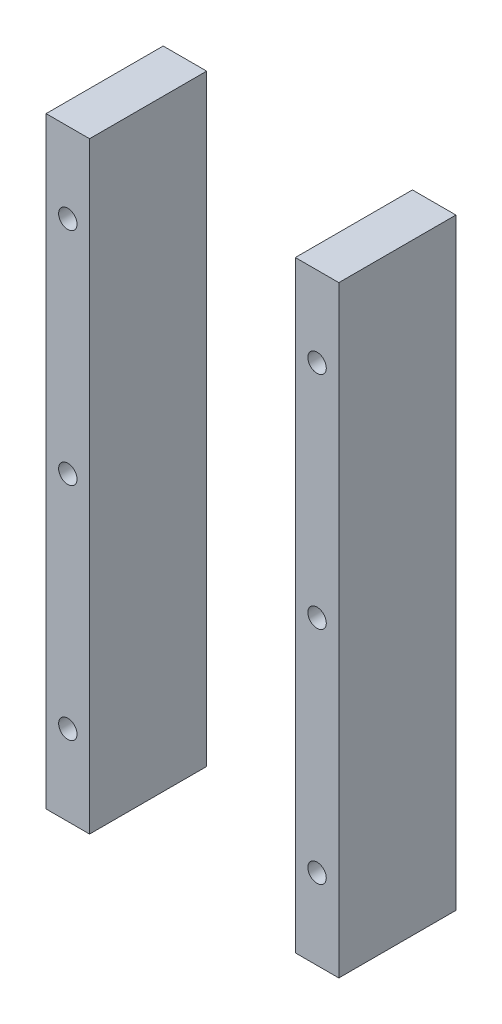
ISO-10303-21;
HEADER;
FILE_DESCRIPTION(('STEP AP214'),'2;1');
FILE_NAME('part.step','',(''),(''),'','','');
FILE_SCHEMA(('AUTOMOTIVE_DESIGN { 1 0 10303 214 1 1 1 1 }'));
ENDSEC;
DATA;
#1=APPLICATION_CONTEXT('core data for automotive mechanical design processes');
#2=APPLICATION_PROTOCOL_DEFINITION('international standard','automotive_design',2000,#1);
#3=PRODUCT_CONTEXT('',#1,'mechanical');
#4=PRODUCT('Part','Part','',(#3));
#5=PRODUCT_RELATED_PRODUCT_CATEGORY('part','',(#4));
#6=PRODUCT_DEFINITION_FORMATION('','',#4);
#7=PRODUCT_DEFINITION_CONTEXT('part definition',#1,'design');
#8=PRODUCT_DEFINITION('design','',#6,#7);
#9=PRODUCT_DEFINITION_SHAPE('','',#8);
#10=(LENGTH_UNIT() NAMED_UNIT(*) SI_UNIT(.MILLI.,.METRE.));
#11=(NAMED_UNIT(*) PLANE_ANGLE_UNIT() SI_UNIT($,.RADIAN.));
#12=(NAMED_UNIT(*) SI_UNIT($,.STERADIAN.) SOLID_ANGLE_UNIT());
#13=UNCERTAINTY_MEASURE_WITH_UNIT(LENGTH_MEASURE(1.E-05),#10,'distance_accuracy_value','');
#14=(GEOMETRIC_REPRESENTATION_CONTEXT(3) GLOBAL_UNCERTAINTY_ASSIGNED_CONTEXT((#13)) GLOBAL_UNIT_ASSIGNED_CONTEXT((#10,
#11,#12)) REPRESENTATION_CONTEXT('',''));
#15=CARTESIAN_POINT('',(0.,0.,0.));
#16=DIRECTION('',(0.,0.,1.));
#17=DIRECTION('',(1.,0.,0.));
#18=AXIS2_PLACEMENT_3D('',#15,#16,#17);
#19=CARTESIAN_POINT('',(136.,-180.,70.));
#20=DIRECTION('',(1.,0.,0.));
#21=DIRECTION('',(0.,0.,-1.));
#22=AXIS2_PLACEMENT_3D('',#19,#20,#21);
#23=PLANE('',#22);
#24=DIRECTION('',(0.,-1.,0.));
#25=VECTOR('',#24,1.);
#26=CARTESIAN_POINT('',(136.,-180.,0.));
#27=LINE('',#26,#25);
#28=CARTESIAN_POINT('',(136.,180.,0.));
#29=VERTEX_POINT('',#28);
#30=CARTESIAN_POINT('',(136.,-180.,0.));
#31=VERTEX_POINT('',#30);
#32=EDGE_CURVE('E106',#29,#31,#27,.T.);
#33=ORIENTED_EDGE('',*,*,#32,.T.);
#34=DIRECTION('',(0.,0.,-1.));
#35=VECTOR('',#34,1.);
#36=CARTESIAN_POINT('',(136.,-180.,70.));
#37=LINE('',#36,#35);
#38=CARTESIAN_POINT('',(136.,-180.,70.));
#39=VERTEX_POINT('',#38);
#40=EDGE_CURVE('E12',#39,#31,#37,.T.);
#41=ORIENTED_EDGE('',*,*,#40,.F.);
#42=DIRECTION('',(0.,-1.,0.));
#43=VECTOR('',#42,1.);
#44=CARTESIAN_POINT('',(136.,-180.,70.));
#45=LINE('',#44,#43);
#46=CARTESIAN_POINT('',(136.,180.,70.));
#47=VERTEX_POINT('',#46);
#48=EDGE_CURVE('E94',#47,#39,#45,.T.);
#49=ORIENTED_EDGE('',*,*,#48,.F.);
#50=DIRECTION('',(0.,0.,-1.));
#51=VECTOR('',#50,1.);
#52=CARTESIAN_POINT('',(136.,180.,70.));
#53=LINE('',#52,#51);
#54=EDGE_CURVE('E102',#47,#29,#53,.T.);
#55=ORIENTED_EDGE('',*,*,#54,.T.);
#56=EDGE_LOOP('',(#33,#41,#49,#55));
#57=FACE_BOUND('',#56,.T.);
#58=ADVANCED_FACE('F43',(#57),#23,.F.);
#59=CARTESIAN_POINT('',(162.,-180.,70.));
#60=DIRECTION('',(0.,1.,0.));
#61=DIRECTION('',(0.,0.,1.));
#62=AXIS2_PLACEMENT_3D('',#59,#60,#61);
#63=PLANE('',#62);
#64=DIRECTION('',(1.,0.,0.));
#65=VECTOR('',#64,1.);
#66=CARTESIAN_POINT('',(162.,-180.,0.));
#67=LINE('',#66,#65);
#68=CARTESIAN_POINT('',(162.,-180.,0.));
#69=VERTEX_POINT('',#68);
#70=EDGE_CURVE('E98',#31,#69,#67,.T.);
#71=ORIENTED_EDGE('',*,*,#70,.T.);
#72=DIRECTION('',(0.,0.,-1.));
#73=VECTOR('',#72,1.);
#74=CARTESIAN_POINT('',(162.,-180.,70.));
#75=LINE('',#74,#73);
#76=CARTESIAN_POINT('',(162.,-180.,70.));
#77=VERTEX_POINT('',#76);
#78=EDGE_CURVE('E51',#77,#69,#75,.T.);
#79=ORIENTED_EDGE('',*,*,#78,.F.);
#80=DIRECTION('',(1.,0.,0.));
#81=VECTOR('',#80,1.);
#82=CARTESIAN_POINT('',(162.,-180.,70.));
#83=LINE('',#82,#81);
#84=EDGE_CURVE('E89',#39,#77,#83,.T.);
#85=ORIENTED_EDGE('',*,*,#84,.F.);
#86=ORIENTED_EDGE('',*,*,#40,.T.);
#87=EDGE_LOOP('',(#71,#79,#85,#86));
#88=FACE_BOUND('',#87,.T.);
#89=ADVANCED_FACE('F97',(#88),#63,.F.);
#90=CARTESIAN_POINT('',(162.,180.,70.));
#91=DIRECTION('',(-1.,0.,0.));
#92=DIRECTION('',(0.,-1.,0.));
#93=AXIS2_PLACEMENT_3D('',#90,#91,#92);
#94=PLANE('',#93);
#95=DIRECTION('',(0.,1.,0.));
#96=VECTOR('',#95,1.);
#97=CARTESIAN_POINT('',(162.,180.,0.));
#98=LINE('',#97,#96);
#99=CARTESIAN_POINT('',(162.,180.,0.));
#100=VERTEX_POINT('',#99);
#101=EDGE_CURVE('E76',#69,#100,#98,.T.);
#102=ORIENTED_EDGE('',*,*,#101,.T.);
#103=DIRECTION('',(0.,0.,-1.));
#104=VECTOR('',#103,1.);
#105=CARTESIAN_POINT('',(162.,180.,70.));
#106=LINE('',#105,#104);
#107=CARTESIAN_POINT('',(162.,180.,70.));
#108=VERTEX_POINT('',#107);
#109=EDGE_CURVE('E99',#108,#100,#106,.T.);
#110=ORIENTED_EDGE('',*,*,#109,.F.);
#111=DIRECTION('',(0.,1.,0.));
#112=VECTOR('',#111,1.);
#113=CARTESIAN_POINT('',(162.,180.,70.));
#114=LINE('',#113,#112);
#115=EDGE_CURVE('E92',#77,#108,#114,.T.);
#116=ORIENTED_EDGE('',*,*,#115,.F.);
#117=ORIENTED_EDGE('',*,*,#78,.T.);
#118=EDGE_LOOP('',(#102,#110,#116,#117));
#119=FACE_BOUND('',#118,.T.);
#120=ADVANCED_FACE('F100',(#119),#94,.F.);
#121=CARTESIAN_POINT('',(136.,180.,70.));
#122=DIRECTION('',(0.,-1.,0.));
#123=DIRECTION('',(0.,0.,-1.));
#124=AXIS2_PLACEMENT_3D('',#121,#122,#123);
#125=PLANE('',#124);
#126=DIRECTION('',(-1.,0.,0.));
#127=VECTOR('',#126,1.);
#128=CARTESIAN_POINT('',(136.,180.,0.));
#129=LINE('',#128,#127);
#130=EDGE_CURVE('E82',#100,#29,#129,.T.);
#131=ORIENTED_EDGE('',*,*,#130,.T.);
#132=ORIENTED_EDGE('',*,*,#54,.F.);
#133=DIRECTION('',(-1.,0.,0.));
#134=VECTOR('',#133,1.);
#135=CARTESIAN_POINT('',(136.,180.,70.));
#136=LINE('',#135,#134);
#137=EDGE_CURVE('E59',#108,#47,#136,.T.);
#138=ORIENTED_EDGE('',*,*,#137,.F.);
#139=ORIENTED_EDGE('',*,*,#109,.T.);
#140=EDGE_LOOP('',(#131,#132,#138,#139));
#141=FACE_BOUND('',#140,.T.);
#142=ADVANCED_FACE('F114',(#141),#125,.F.);
#143=CARTESIAN_POINT('',(0.,0.,70.));
#144=DIRECTION('',(0.,0.,-1.));
#145=DIRECTION('',(-1.,0.,0.));
#146=AXIS2_PLACEMENT_3D('',#143,#144,#145);
#147=PLANE('',#146);
#148=CARTESIAN_POINT('',(149.,-132.,70.));
#149=DIRECTION('',(0.,0.,1.));
#150=DIRECTION('',(1.,0.,0.));
#151=AXIS2_PLACEMENT_3D('',#148,#149,#150);
#152=CIRCLE('',#151,5.49999999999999);
#153=CARTESIAN_POINT('',(154.5,-132.,70.));
#154=VERTEX_POINT('',#153);
#155=EDGE_CURVE('E132',#154,#154,#152,.T.);
#156=ORIENTED_EDGE('',*,*,#155,.F.);
#157=EDGE_LOOP('',(#156));
#158=FACE_BOUND('',#157,.T.);
#159=CARTESIAN_POINT('',(149.,1.11022302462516E-13,70.));
#160=DIRECTION('',(0.,0.,1.));
#161=DIRECTION('',(-1.,0.,0.));
#162=AXIS2_PLACEMENT_3D('',#159,#160,#161);
#163=CIRCLE('',#162,5.50000000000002);
#164=CARTESIAN_POINT('',(143.5,1.11022302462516E-13,70.));
#165=VERTEX_POINT('',#164);
#166=EDGE_CURVE('E126',#165,#165,#163,.T.);
#167=ORIENTED_EDGE('',*,*,#166,.F.);
#168=EDGE_LOOP('',(#167));
#169=FACE_BOUND('',#168,.T.);
#170=CARTESIAN_POINT('',(149.,132.,70.));
#171=DIRECTION('',(0.,0.,1.));
#172=DIRECTION('',(-1.,0.,0.));
#173=AXIS2_PLACEMENT_3D('',#170,#171,#172);
#174=CIRCLE('',#173,5.49999999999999);
#175=CARTESIAN_POINT('',(143.5,132.,70.));
#176=VERTEX_POINT('',#175);
#177=EDGE_CURVE('E120',#176,#176,#174,.T.);
#178=ORIENTED_EDGE('',*,*,#177,.F.);
#179=EDGE_LOOP('',(#178));
#180=FACE_BOUND('',#179,.T.);
#181=ORIENTED_EDGE('',*,*,#48,.T.);
#182=ORIENTED_EDGE('',*,*,#84,.T.);
#183=ORIENTED_EDGE('',*,*,#115,.T.);
#184=ORIENTED_EDGE('',*,*,#137,.T.);
#185=EDGE_LOOP('',(#181,#182,#183,#184));
#186=FACE_BOUND('',#185,.T.);
#187=ADVANCED_FACE('F90',(#158,#169,#180,#186),#147,.F.);
#188=CARTESIAN_POINT('',(0.,0.,0.));
#189=DIRECTION('',(0.,0.,-1.));
#190=DIRECTION('',(-1.,0.,0.));
#191=AXIS2_PLACEMENT_3D('',#188,#189,#190);
#192=PLANE('',#191);
#193=CARTESIAN_POINT('',(149.,-132.,0.));
#194=DIRECTION('',(0.,0.,1.));
#195=DIRECTION('',(1.,0.,0.));
#196=AXIS2_PLACEMENT_3D('',#193,#194,#195);
#197=CIRCLE('',#196,5.49999999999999);
#198=CARTESIAN_POINT('',(154.5,-132.,0.));
#199=VERTEX_POINT('',#198);
#200=EDGE_CURVE('E109',#199,#199,#197,.T.);
#201=ORIENTED_EDGE('',*,*,#200,.T.);
#202=EDGE_LOOP('',(#201));
#203=FACE_BOUND('',#202,.T.);
#204=CARTESIAN_POINT('',(149.,1.11022302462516E-13,0.));
#205=DIRECTION('',(0.,0.,1.));
#206=DIRECTION('',(-1.,0.,0.));
#207=AXIS2_PLACEMENT_3D('',#204,#205,#206);
#208=CIRCLE('',#207,5.50000000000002);
#209=CARTESIAN_POINT('',(143.5,1.11022302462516E-13,0.));
#210=VERTEX_POINT('',#209);
#211=EDGE_CURVE('E129',#210,#210,#208,.T.);
#212=ORIENTED_EDGE('',*,*,#211,.T.);
#213=EDGE_LOOP('',(#212));
#214=FACE_BOUND('',#213,.T.);
#215=CARTESIAN_POINT('',(149.,132.,0.));
#216=DIRECTION('',(0.,0.,1.));
#217=DIRECTION('',(-1.,0.,0.));
#218=AXIS2_PLACEMENT_3D('',#215,#216,#217);
#219=CIRCLE('',#218,5.49999999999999);
#220=CARTESIAN_POINT('',(143.5,132.,0.));
#221=VERTEX_POINT('',#220);
#222=EDGE_CURVE('E123',#221,#221,#219,.T.);
#223=ORIENTED_EDGE('',*,*,#222,.T.);
#224=EDGE_LOOP('',(#223));
#225=FACE_BOUND('',#224,.T.);
#226=ORIENTED_EDGE('',*,*,#32,.F.);
#227=ORIENTED_EDGE('',*,*,#130,.F.);
#228=ORIENTED_EDGE('',*,*,#101,.F.);
#229=ORIENTED_EDGE('',*,*,#70,.F.);
#230=EDGE_LOOP('',(#226,#227,#228,#229));
#231=FACE_BOUND('',#230,.T.);
#232=ADVANCED_FACE('F117',(#203,#214,#225,#231),#192,.T.);
#233=CARTESIAN_POINT('',(149.,132.,0.));
#234=DIRECTION('',(0.,0.,1.));
#235=DIRECTION('',(1.,0.,0.));
#236=AXIS2_PLACEMENT_3D('',#233,#234,#235);
#237=CYLINDRICAL_SURFACE('',#236,5.49999999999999);
#238=ORIENTED_EDGE('',*,*,#222,.F.);
#239=EDGE_LOOP('',(#238));
#240=FACE_BOUND('',#239,.T.);
#241=ORIENTED_EDGE('',*,*,#177,.T.);
#242=EDGE_LOOP('',(#241));
#243=FACE_BOUND('',#242,.T.);
#244=ADVANCED_FACE('F154',(#240,#243),#237,.F.);
#245=CARTESIAN_POINT('',(149.,1.11022302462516E-13,0.));
#246=DIRECTION('',(0.,0.,1.));
#247=DIRECTION('',(1.,0.,0.));
#248=AXIS2_PLACEMENT_3D('',#245,#246,#247);
#249=CYLINDRICAL_SURFACE('',#248,5.50000000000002);
#250=ORIENTED_EDGE('',*,*,#211,.F.);
#251=EDGE_LOOP('',(#250));
#252=FACE_BOUND('',#251,.T.);
#253=ORIENTED_EDGE('',*,*,#166,.T.);
#254=EDGE_LOOP('',(#253));
#255=FACE_BOUND('',#254,.T.);
#256=ADVANCED_FACE('F143',(#252,#255),#249,.F.);
#257=CARTESIAN_POINT('',(149.,-132.,0.));
#258=DIRECTION('',(0.,0.,1.));
#259=DIRECTION('',(1.,0.,0.));
#260=AXIS2_PLACEMENT_3D('',#257,#258,#259);
#261=CYLINDRICAL_SURFACE('',#260,5.49999999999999);
#262=ORIENTED_EDGE('',*,*,#200,.F.);
#263=EDGE_LOOP('',(#262));
#264=FACE_BOUND('',#263,.T.);
#265=ORIENTED_EDGE('',*,*,#155,.T.);
#266=EDGE_LOOP('',(#265));
#267=FACE_BOUND('',#266,.T.);
#268=ADVANCED_FACE('F140',(#264,#267),#261,.F.);
#269=CLOSED_SHELL('',(#58,#89,#120,#142,#187,#232,#244,#256,#268));
#270=MANIFOLD_SOLID_BREP('B2',#269);
#271=CARTESIAN_POINT('',(-13.,-180.,70.));
#272=DIRECTION('',(1.,0.,0.));
#273=DIRECTION('',(0.,0.,-1.));
#274=AXIS2_PLACEMENT_3D('',#271,#272,#273);
#275=PLANE('',#274);
#276=DIRECTION('',(0.,-1.,0.));
#277=VECTOR('',#276,1.);
#278=CARTESIAN_POINT('',(-13.,-180.,0.));
#279=LINE('',#278,#277);
#280=CARTESIAN_POINT('',(-13.,180.,0.));
#281=VERTEX_POINT('',#280);
#282=CARTESIAN_POINT('',(-13.,-180.,0.));
#283=VERTEX_POINT('',#282);
#284=EDGE_CURVE('E293',#281,#283,#279,.T.);
#285=ORIENTED_EDGE('',*,*,#284,.T.);
#286=DIRECTION('',(0.,0.,-1.));
#287=VECTOR('',#286,1.);
#288=CARTESIAN_POINT('',(-13.,-180.,70.));
#289=LINE('',#288,#287);
#290=CARTESIAN_POINT('',(-13.,-180.,70.));
#291=VERTEX_POINT('',#290);
#292=EDGE_CURVE('E41',#291,#283,#289,.T.);
#293=ORIENTED_EDGE('',*,*,#292,.F.);
#294=DIRECTION('',(0.,-1.,0.));
#295=VECTOR('',#294,1.);
#296=CARTESIAN_POINT('',(-13.,-180.,70.));
#297=LINE('',#296,#295);
#298=CARTESIAN_POINT('',(-13.,180.,70.));
#299=VERTEX_POINT('',#298);
#300=EDGE_CURVE('E281',#299,#291,#297,.T.);
#301=ORIENTED_EDGE('',*,*,#300,.F.);
#302=DIRECTION('',(0.,0.,-1.));
#303=VECTOR('',#302,1.);
#304=CARTESIAN_POINT('',(-13.,180.,70.));
#305=LINE('',#304,#303);
#306=EDGE_CURVE('E289',#299,#281,#305,.T.);
#307=ORIENTED_EDGE('',*,*,#306,.T.);
#308=EDGE_LOOP('',(#285,#293,#301,#307));
#309=FACE_BOUND('',#308,.T.);
#310=ADVANCED_FACE('F230',(#309),#275,.F.);
#311=CARTESIAN_POINT('',(13.,-180.,70.));
#312=DIRECTION('',(0.,1.,0.));
#313=DIRECTION('',(0.,0.,1.));
#314=AXIS2_PLACEMENT_3D('',#311,#312,#313);
#315=PLANE('',#314);
#316=DIRECTION('',(1.,0.,0.));
#317=VECTOR('',#316,1.);
#318=CARTESIAN_POINT('',(13.,-180.,0.));
#319=LINE('',#318,#317);
#320=CARTESIAN_POINT('',(13.,-180.,0.));
#321=VERTEX_POINT('',#320);
#322=EDGE_CURVE('E285',#283,#321,#319,.T.);
#323=ORIENTED_EDGE('',*,*,#322,.T.);
#324=DIRECTION('',(0.,0.,-1.));
#325=VECTOR('',#324,1.);
#326=CARTESIAN_POINT('',(13.,-180.,70.));
#327=LINE('',#326,#325);
#328=CARTESIAN_POINT('',(13.,-180.,70.));
#329=VERTEX_POINT('',#328);
#330=EDGE_CURVE('E238',#329,#321,#327,.T.);
#331=ORIENTED_EDGE('',*,*,#330,.F.);
#332=DIRECTION('',(1.,0.,0.));
#333=VECTOR('',#332,1.);
#334=CARTESIAN_POINT('',(13.,-180.,70.));
#335=LINE('',#334,#333);
#336=EDGE_CURVE('E276',#291,#329,#335,.T.);
#337=ORIENTED_EDGE('',*,*,#336,.F.);
#338=ORIENTED_EDGE('',*,*,#292,.T.);
#339=EDGE_LOOP('',(#323,#331,#337,#338));
#340=FACE_BOUND('',#339,.T.);
#341=ADVANCED_FACE('F284',(#340),#315,.F.);
#342=CARTESIAN_POINT('',(13.,-180.,70.));
#343=DIRECTION('',(-1.,0.,0.));
#344=DIRECTION('',(0.,0.,1.));
#345=AXIS2_PLACEMENT_3D('',#342,#343,#344);
#346=PLANE('',#345);
#347=DIRECTION('',(0.,1.,0.));
#348=VECTOR('',#347,1.);
#349=CARTESIAN_POINT('',(13.,-180.,0.));
#350=LINE('',#349,#348);
#351=CARTESIAN_POINT('',(13.,180.,0.));
#352=VERTEX_POINT('',#351);
#353=EDGE_CURVE('E263',#321,#352,#350,.T.);
#354=ORIENTED_EDGE('',*,*,#353,.T.);
#355=DIRECTION('',(0.,0.,-1.));
#356=VECTOR('',#355,1.);
#357=CARTESIAN_POINT('',(13.,180.,70.));
#358=LINE('',#357,#356);
#359=CARTESIAN_POINT('',(13.,180.,70.));
#360=VERTEX_POINT('',#359);
#361=EDGE_CURVE('E286',#360,#352,#358,.T.);
#362=ORIENTED_EDGE('',*,*,#361,.F.);
#363=DIRECTION('',(0.,1.,0.));
#364=VECTOR('',#363,1.);
#365=CARTESIAN_POINT('',(13.,-180.,70.));
#366=LINE('',#365,#364);
#367=EDGE_CURVE('E279',#329,#360,#366,.T.);
#368=ORIENTED_EDGE('',*,*,#367,.F.);
#369=ORIENTED_EDGE('',*,*,#330,.T.);
#370=EDGE_LOOP('',(#354,#362,#368,#369));
#371=FACE_BOUND('',#370,.T.);
#372=ADVANCED_FACE('F287',(#371),#346,.F.);
#373=CARTESIAN_POINT('',(13.,180.,70.));
#374=DIRECTION('',(0.,-1.,0.));
#375=DIRECTION('',(0.,0.,-1.));
#376=AXIS2_PLACEMENT_3D('',#373,#374,#375);
#377=PLANE('',#376);
#378=DIRECTION('',(-1.,0.,0.));
#379=VECTOR('',#378,1.);
#380=CARTESIAN_POINT('',(13.,180.,0.));
#381=LINE('',#380,#379);
#382=EDGE_CURVE('E269',#352,#281,#381,.T.);
#383=ORIENTED_EDGE('',*,*,#382,.T.);
#384=ORIENTED_EDGE('',*,*,#306,.F.);
#385=DIRECTION('',(-1.,0.,0.));
#386=VECTOR('',#385,1.);
#387=CARTESIAN_POINT('',(13.,180.,70.));
#388=LINE('',#387,#386);
#389=EDGE_CURVE('E246',#360,#299,#388,.T.);
#390=ORIENTED_EDGE('',*,*,#389,.F.);
#391=ORIENTED_EDGE('',*,*,#361,.T.);
#392=EDGE_LOOP('',(#383,#384,#390,#391));
#393=FACE_BOUND('',#392,.T.);
#394=ADVANCED_FACE('F301',(#393),#377,.F.);
#395=CARTESIAN_POINT('',(0.,0.,70.));
#396=DIRECTION('',(0.,0.,1.));
#397=DIRECTION('',(1.,0.,0.));
#398=AXIS2_PLACEMENT_3D('',#395,#396,#397);
#399=PLANE('',#398);
#400=CARTESIAN_POINT('',(0.,132.,70.));
#401=DIRECTION('',(0.,0.,1.));
#402=DIRECTION('',(1.,0.,0.));
#403=AXIS2_PLACEMENT_3D('',#400,#401,#402);
#404=CIRCLE('',#403,5.5);
#405=CARTESIAN_POINT('',(5.50000000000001,132.,70.));
#406=VERTEX_POINT('',#405);
#407=EDGE_CURVE('E319',#406,#406,#404,.T.);
#408=ORIENTED_EDGE('',*,*,#407,.F.);
#409=EDGE_LOOP('',(#408));
#410=FACE_BOUND('',#409,.T.);
#411=CARTESIAN_POINT('',(0.,0.,70.));
#412=DIRECTION('',(0.,0.,1.));
#413=DIRECTION('',(1.,0.,0.));
#414=AXIS2_PLACEMENT_3D('',#411,#412,#413);
#415=CIRCLE('',#414,5.5);
#416=CARTESIAN_POINT('',(5.5,0.,70.));
#417=VERTEX_POINT('',#416);
#418=EDGE_CURVE('E313',#417,#417,#415,.T.);
#419=ORIENTED_EDGE('',*,*,#418,.F.);
#420=EDGE_LOOP('',(#419));
#421=FACE_BOUND('',#420,.T.);
#422=CARTESIAN_POINT('',(0.,-132.,70.));
#423=DIRECTION('',(0.,0.,1.));
#424=DIRECTION('',(-1.,0.,0.));
#425=AXIS2_PLACEMENT_3D('',#422,#423,#424);
#426=CIRCLE('',#425,5.5);
#427=CARTESIAN_POINT('',(-5.49999999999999,-132.,70.));
#428=VERTEX_POINT('',#427);
#429=EDGE_CURVE('E307',#428,#428,#426,.T.);
#430=ORIENTED_EDGE('',*,*,#429,.F.);
#431=EDGE_LOOP('',(#430));
#432=FACE_BOUND('',#431,.T.);
#433=ORIENTED_EDGE('',*,*,#300,.T.);
#434=ORIENTED_EDGE('',*,*,#336,.T.);
#435=ORIENTED_EDGE('',*,*,#367,.T.);
#436=ORIENTED_EDGE('',*,*,#389,.T.);
#437=EDGE_LOOP('',(#433,#434,#435,#436));
#438=FACE_BOUND('',#437,.T.);
#439=ADVANCED_FACE('F277',(#410,#421,#432,#438),#399,.T.);
#440=CARTESIAN_POINT('',(0.,0.,0.));
#441=DIRECTION('',(0.,0.,1.));
#442=DIRECTION('',(1.,0.,0.));
#443=AXIS2_PLACEMENT_3D('',#440,#441,#442);
#444=PLANE('',#443);
#445=CARTESIAN_POINT('',(0.,132.,0.));
#446=DIRECTION('',(0.,0.,1.));
#447=DIRECTION('',(1.,0.,0.));
#448=AXIS2_PLACEMENT_3D('',#445,#446,#447);
#449=CIRCLE('',#448,5.5);
#450=CARTESIAN_POINT('',(5.50000000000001,132.,0.));
#451=VERTEX_POINT('',#450);
#452=EDGE_CURVE('E296',#451,#451,#449,.T.);
#453=ORIENTED_EDGE('',*,*,#452,.T.);
#454=EDGE_LOOP('',(#453));
#455=FACE_BOUND('',#454,.T.);
#456=CARTESIAN_POINT('',(0.,0.,0.));
#457=DIRECTION('',(0.,0.,1.));
#458=DIRECTION('',(1.,0.,0.));
#459=AXIS2_PLACEMENT_3D('',#456,#457,#458);
#460=CIRCLE('',#459,5.5);
#461=CARTESIAN_POINT('',(5.5,0.,0.));
#462=VERTEX_POINT('',#461);
#463=EDGE_CURVE('E316',#462,#462,#460,.T.);
#464=ORIENTED_EDGE('',*,*,#463,.T.);
#465=EDGE_LOOP('',(#464));
#466=FACE_BOUND('',#465,.T.);
#467=CARTESIAN_POINT('',(0.,-132.,0.));
#468=DIRECTION('',(0.,0.,1.));
#469=DIRECTION('',(-1.,0.,0.));
#470=AXIS2_PLACEMENT_3D('',#467,#468,#469);
#471=CIRCLE('',#470,5.5);
#472=CARTESIAN_POINT('',(-5.49999999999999,-132.,0.));
#473=VERTEX_POINT('',#472);
#474=EDGE_CURVE('E310',#473,#473,#471,.T.);
#475=ORIENTED_EDGE('',*,*,#474,.T.);
#476=EDGE_LOOP('',(#475));
#477=FACE_BOUND('',#476,.T.);
#478=ORIENTED_EDGE('',*,*,#284,.F.);
#479=ORIENTED_EDGE('',*,*,#382,.F.);
#480=ORIENTED_EDGE('',*,*,#353,.F.);
#481=ORIENTED_EDGE('',*,*,#322,.F.);
#482=EDGE_LOOP('',(#478,#479,#480,#481));
#483=FACE_BOUND('',#482,.T.);
#484=ADVANCED_FACE('F304',(#455,#466,#477,#483),#444,.F.);
#485=CARTESIAN_POINT('',(0.,-132.,0.));
#486=DIRECTION('',(0.,0.,1.));
#487=DIRECTION('',(1.,0.,0.));
#488=AXIS2_PLACEMENT_3D('',#485,#486,#487);
#489=CYLINDRICAL_SURFACE('',#488,5.5);
#490=ORIENTED_EDGE('',*,*,#474,.F.);
#491=EDGE_LOOP('',(#490));
#492=FACE_BOUND('',#491,.T.);
#493=ORIENTED_EDGE('',*,*,#429,.T.);
#494=EDGE_LOOP('',(#493));
#495=FACE_BOUND('',#494,.T.);
#496=ADVANCED_FACE('F341',(#492,#495),#489,.F.);
#497=CARTESIAN_POINT('',(0.,0.,0.));
#498=DIRECTION('',(0.,0.,1.));
#499=DIRECTION('',(1.,0.,0.));
#500=AXIS2_PLACEMENT_3D('',#497,#498,#499);
#501=CYLINDRICAL_SURFACE('',#500,5.5);
#502=ORIENTED_EDGE('',*,*,#463,.F.);
#503=EDGE_LOOP('',(#502));
#504=FACE_BOUND('',#503,.T.);
#505=ORIENTED_EDGE('',*,*,#418,.T.);
#506=EDGE_LOOP('',(#505));
#507=FACE_BOUND('',#506,.T.);
#508=ADVANCED_FACE('F330',(#504,#507),#501,.F.);
#509=CARTESIAN_POINT('',(0.,132.,0.));
#510=DIRECTION('',(0.,0.,1.));
#511=DIRECTION('',(1.,0.,0.));
#512=AXIS2_PLACEMENT_3D('',#509,#510,#511);
#513=CYLINDRICAL_SURFACE('',#512,5.5);
#514=ORIENTED_EDGE('',*,*,#452,.F.);
#515=EDGE_LOOP('',(#514));
#516=FACE_BOUND('',#515,.T.);
#517=ORIENTED_EDGE('',*,*,#407,.T.);
#518=EDGE_LOOP('',(#517));
#519=FACE_BOUND('',#518,.T.);
#520=ADVANCED_FACE('F327',(#516,#519),#513,.F.);
#521=CLOSED_SHELL('',(#310,#341,#372,#394,#439,#484,#496,#508,#520));
#522=MANIFOLD_SOLID_BREP('B6',#521);
#523=ADVANCED_BREP_SHAPE_REPRESENTATION('',(#18,#270,#522),#14);
#524=SHAPE_DEFINITION_REPRESENTATION(#9,#523);
ENDSEC;
END-ISO-10303-21;
